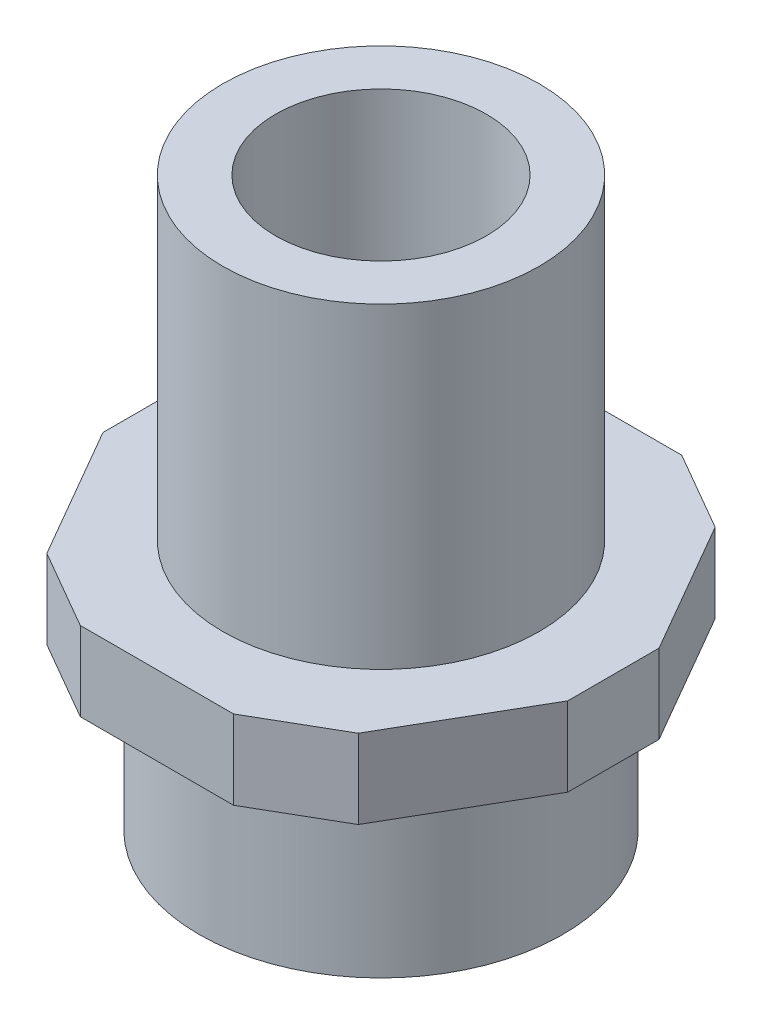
ISO-10303-21;
HEADER;
FILE_DESCRIPTION(('STEP AP214'),'2;1');
FILE_NAME('part.step','',(''),(''),'','','');
FILE_SCHEMA(('AUTOMOTIVE_DESIGN { 1 0 10303 214 1 1 1 1 }'));
ENDSEC;
DATA;
#1=APPLICATION_CONTEXT('core data for automotive mechanical design processes');
#2=APPLICATION_PROTOCOL_DEFINITION('international standard','automotive_design',2000,#1);
#3=PRODUCT_CONTEXT('',#1,'mechanical');
#4=PRODUCT('Part','Part','',(#3));
#5=PRODUCT_RELATED_PRODUCT_CATEGORY('part','',(#4));
#6=PRODUCT_DEFINITION_FORMATION('','',#4);
#7=PRODUCT_DEFINITION_CONTEXT('part definition',#1,'design');
#8=PRODUCT_DEFINITION('design','',#6,#7);
#9=PRODUCT_DEFINITION_SHAPE('','',#8);
#10=(LENGTH_UNIT() NAMED_UNIT(*) SI_UNIT(.MILLI.,.METRE.));
#11=(NAMED_UNIT(*) PLANE_ANGLE_UNIT() SI_UNIT($,.RADIAN.));
#12=(NAMED_UNIT(*) SI_UNIT($,.STERADIAN.) SOLID_ANGLE_UNIT());
#13=UNCERTAINTY_MEASURE_WITH_UNIT(LENGTH_MEASURE(1.E-05),#10,'distance_accuracy_value','');
#14=(GEOMETRIC_REPRESENTATION_CONTEXT(3) GLOBAL_UNCERTAINTY_ASSIGNED_CONTEXT((#13)) GLOBAL_UNIT_ASSIGNED_CONTEXT((#10,
#11,#12)) REPRESENTATION_CONTEXT('',''));
#15=CARTESIAN_POINT('',(0.,0.,0.));
#16=DIRECTION('',(0.,0.,1.));
#17=DIRECTION('',(1.,0.,0.));
#18=AXIS2_PLACEMENT_3D('',#15,#16,#17);
#19=CARTESIAN_POINT('',(9.81495457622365,0.,0.));
#20=DIRECTION('',(0.,1.,0.));
#21=DIRECTION('',(0.,0.,1.));
#22=AXIS2_PLACEMENT_3D('',#19,#20,#21);
#23=PLANE('',#22);
#24=DIRECTION('',(0.5,0.,-0.866025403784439));
#25=VECTOR('',#24,1.);
#26=CARTESIAN_POINT('',(4.90747728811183,0.,8.5));
#27=LINE('',#26,#25);
#28=CARTESIAN_POINT('',(5.90747728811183,0.,6.76794919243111));
#29=VERTEX_POINT('',#28);
#30=CARTESIAN_POINT('',(8.81495457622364,0.,1.73205080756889));
#31=VERTEX_POINT('',#30);
#32=EDGE_CURVE('E144',#29,#31,#27,.T.);
#33=ORIENTED_EDGE('',*,*,#32,.F.);
#34=DIRECTION('',(0.866025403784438,0.,-0.5));
#35=VECTOR('',#34,1.);
#36=CARTESIAN_POINT('',(5.90747728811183,0.,6.76794919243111));
#37=LINE('',#36,#35);
#38=CARTESIAN_POINT('',(2.90747728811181,0.,8.5));
#39=VERTEX_POINT('',#38);
#40=EDGE_CURVE('E127',#29,#39,#37,.F.);
#41=ORIENTED_EDGE('',*,*,#40,.T.);
#42=DIRECTION('',(1.,0.,0.));
#43=VECTOR('',#42,1.);
#44=CARTESIAN_POINT('',(-4.90747728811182,0.,8.5));
#45=LINE('',#44,#43);
#46=CARTESIAN_POINT('',(-2.90747728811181,0.,8.5));
#47=VERTEX_POINT('',#46);
#48=EDGE_CURVE('E173',#47,#39,#45,.T.);
#49=ORIENTED_EDGE('',*,*,#48,.F.);
#50=DIRECTION('',(0.866025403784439,0.,0.5));
#51=VECTOR('',#50,1.);
#52=CARTESIAN_POINT('',(-2.90747728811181,0.,8.5));
#53=LINE('',#52,#51);
#54=CARTESIAN_POINT('',(-5.90747728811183,0.,6.76794919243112));
#55=VERTEX_POINT('',#54);
#56=EDGE_CURVE('E183',#47,#55,#53,.F.);
#57=ORIENTED_EDGE('',*,*,#56,.T.);
#58=DIRECTION('',(0.5,0.,0.866025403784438));
#59=VECTOR('',#58,1.);
#60=CARTESIAN_POINT('',(-9.81495457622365,0.,0.));
#61=LINE('',#60,#59);
#62=CARTESIAN_POINT('',(-8.81495457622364,0.,1.73205080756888));
#63=VERTEX_POINT('',#62);
#64=EDGE_CURVE('E171',#63,#55,#61,.T.);
#65=ORIENTED_EDGE('',*,*,#64,.F.);
#66=DIRECTION('',(0.,0.,1.));
#67=VECTOR('',#66,1.);
#68=CARTESIAN_POINT('',(-8.81495457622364,0.,1.73205080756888));
#69=LINE('',#68,#67);
#70=CARTESIAN_POINT('',(-8.81495457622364,0.,-1.73205080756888));
#71=VERTEX_POINT('',#70);
#72=EDGE_CURVE('E148',#63,#71,#69,.F.);
#73=ORIENTED_EDGE('',*,*,#72,.T.);
#74=DIRECTION('',(-0.5,0.,0.866025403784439));
#75=VECTOR('',#74,1.);
#76=CARTESIAN_POINT('',(-4.90747728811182,0.,-8.50000000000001));
#77=LINE('',#76,#75);
#78=CARTESIAN_POINT('',(-5.90747728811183,0.,-6.76794919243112));
#79=VERTEX_POINT('',#78);
#80=EDGE_CURVE('E168',#79,#71,#77,.T.);
#81=ORIENTED_EDGE('',*,*,#80,.F.);
#82=DIRECTION('',(-0.866025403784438,0.,0.500000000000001));
#83=VECTOR('',#82,1.);
#84=CARTESIAN_POINT('',(-5.90747728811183,0.,-6.76794919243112));
#85=LINE('',#84,#83);
#86=CARTESIAN_POINT('',(-2.90747728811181,0.,-8.50000000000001));
#87=VERTEX_POINT('',#86);
#88=EDGE_CURVE('E185',#79,#87,#85,.F.);
#89=ORIENTED_EDGE('',*,*,#88,.T.);
#90=DIRECTION('',(-1.,0.,0.));
#91=VECTOR('',#90,1.);
#92=CARTESIAN_POINT('',(4.90747728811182,0.,-8.50000000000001));
#93=LINE('',#92,#91);
#94=CARTESIAN_POINT('',(2.90747728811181,0.,-8.50000000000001));
#95=VERTEX_POINT('',#94);
#96=EDGE_CURVE('E157',#95,#87,#93,.T.);
#97=ORIENTED_EDGE('',*,*,#96,.F.);
#98=DIRECTION('',(-0.866025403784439,0.,-0.5));
#99=VECTOR('',#98,1.);
#100=CARTESIAN_POINT('',(2.90747728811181,0.,-8.50000000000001));
#101=LINE('',#100,#99);
#102=CARTESIAN_POINT('',(5.90747728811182,0.,-6.76794919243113));
#103=VERTEX_POINT('',#102);
#104=EDGE_CURVE('E187',#95,#103,#101,.F.);
#105=ORIENTED_EDGE('',*,*,#104,.T.);
#106=DIRECTION('',(-0.5,0.,-0.866025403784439));
#107=VECTOR('',#106,1.);
#108=CARTESIAN_POINT('',(9.81495457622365,0.,0.));
#109=LINE('',#108,#107);
#110=CARTESIAN_POINT('',(8.81495457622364,0.,-1.73205080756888));
#111=VERTEX_POINT('',#110);
#112=EDGE_CURVE('E153',#111,#103,#109,.T.);
#113=ORIENTED_EDGE('',*,*,#112,.F.);
#114=DIRECTION('',(0.,0.,-1.));
#115=VECTOR('',#114,1.);
#116=CARTESIAN_POINT('',(8.81495457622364,0.,-1.73205080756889));
#117=LINE('',#116,#115);
#118=EDGE_CURVE('E138',#111,#31,#117,.F.);
#119=ORIENTED_EDGE('',*,*,#118,.T.);
#120=EDGE_LOOP('',(#33,#41,#49,#57,#65,#73,#81,#89,#97,#105,#113,#119));
#121=FACE_BOUND('',#120,.T.);
#122=CARTESIAN_POINT('',(0.,0.,0.));
#123=DIRECTION('',(0.,1.,0.));
#124=DIRECTION('',(0.,0.,1.));
#125=AXIS2_PLACEMENT_3D('',#122,#123,#124);
#126=CIRCLE('',#125,6.9);
#127=CARTESIAN_POINT('',(0.,0.,6.9));
#128=VERTEX_POINT('',#127);
#129=EDGE_CURVE('E178',#128,#128,#126,.F.);
#130=ORIENTED_EDGE('',*,*,#129,.F.);
#131=EDGE_LOOP('',(#130));
#132=FACE_BOUND('',#131,.T.);
#133=ADVANCED_FACE('F38',(#121,#132),#23,.F.);
#134=CARTESIAN_POINT('',(9.81495457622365,3.,0.));
#135=DIRECTION('',(0.,1.,0.));
#136=DIRECTION('',(0.,0.,1.));
#137=AXIS2_PLACEMENT_3D('',#134,#135,#136);
#138=PLANE('',#137);
#139=DIRECTION('',(1.,0.,0.));
#140=VECTOR('',#139,1.);
#141=CARTESIAN_POINT('',(-4.90747728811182,3.,8.5));
#142=LINE('',#141,#140);
#143=CARTESIAN_POINT('',(-2.90747728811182,3.,8.5));
#144=VERTEX_POINT('',#143);
#145=CARTESIAN_POINT('',(2.90747728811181,3.,8.50000000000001));
#146=VERTEX_POINT('',#145);
#147=EDGE_CURVE('E163',#144,#146,#142,.T.);
#148=ORIENTED_EDGE('',*,*,#147,.T.);
#149=DIRECTION('',(-0.866025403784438,0.,0.5));
#150=VECTOR('',#149,1.);
#151=CARTESIAN_POINT('',(11.7686932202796,3.,3.38397459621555));
#152=LINE('',#151,#150);
#153=CARTESIAN_POINT('',(5.90747728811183,3.,6.76794919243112));
#154=VERTEX_POINT('',#153);
#155=EDGE_CURVE('E202',#146,#154,#152,.F.);
#156=ORIENTED_EDGE('',*,*,#155,.T.);
#157=DIRECTION('',(0.5,0.,-0.866025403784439));
#158=VECTOR('',#157,1.);
#159=CARTESIAN_POINT('',(4.90747728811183,3.,8.5));
#160=LINE('',#159,#158);
#161=CARTESIAN_POINT('',(8.81495457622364,3.,1.73205080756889));
#162=VERTEX_POINT('',#161);
#163=EDGE_CURVE('E147',#154,#162,#160,.T.);
#164=ORIENTED_EDGE('',*,*,#163,.T.);
#165=DIRECTION('',(0.,0.,1.));
#166=VECTOR('',#165,1.);
#167=CARTESIAN_POINT('',(8.81495457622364,3.,0.));
#168=LINE('',#167,#166);
#169=CARTESIAN_POINT('',(8.81495457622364,3.,-1.73205080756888));
#170=VERTEX_POINT('',#169);
#171=EDGE_CURVE('E200',#162,#170,#168,.F.);
#172=ORIENTED_EDGE('',*,*,#171,.T.);
#173=DIRECTION('',(-0.5,0.,-0.866025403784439));
#174=VECTOR('',#173,1.);
#175=CARTESIAN_POINT('',(9.81495457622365,3.,0.));
#176=LINE('',#175,#174);
#177=CARTESIAN_POINT('',(5.90747728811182,3.,-6.76794919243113));
#178=VERTEX_POINT('',#177);
#179=EDGE_CURVE('E239',#170,#178,#176,.T.);
#180=ORIENTED_EDGE('',*,*,#179,.T.);
#181=DIRECTION('',(0.866025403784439,0.,0.5));
#182=VECTOR('',#181,1.);
#183=CARTESIAN_POINT('',(11.7686932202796,3.,-3.38397459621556));
#184=LINE('',#183,#182);
#185=CARTESIAN_POINT('',(2.90747728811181,3.,-8.50000000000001));
#186=VERTEX_POINT('',#185);
#187=EDGE_CURVE('E198',#178,#186,#184,.F.);
#188=ORIENTED_EDGE('',*,*,#187,.T.);
#189=DIRECTION('',(-1.,0.,0.));
#190=VECTOR('',#189,1.);
#191=CARTESIAN_POINT('',(4.90747728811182,3.,-8.50000000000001));
#192=LINE('',#191,#190);
#193=CARTESIAN_POINT('',(-2.90747728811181,3.,-8.50000000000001));
#194=VERTEX_POINT('',#193);
#195=EDGE_CURVE('E234',#186,#194,#192,.T.);
#196=ORIENTED_EDGE('',*,*,#195,.T.);
#197=DIRECTION('',(0.866025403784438,0.,-0.500000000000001));
#198=VECTOR('',#197,1.);
#199=CARTESIAN_POINT('',(2.9537386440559,3.,-11.8839745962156));
#200=LINE('',#199,#198);
#201=CARTESIAN_POINT('',(-5.90747728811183,3.,-6.76794919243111));
#202=VERTEX_POINT('',#201);
#203=EDGE_CURVE('E196',#194,#202,#200,.F.);
#204=ORIENTED_EDGE('',*,*,#203,.T.);
#205=DIRECTION('',(-0.5,0.,0.866025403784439));
#206=VECTOR('',#205,1.);
#207=CARTESIAN_POINT('',(-4.90747728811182,3.,-8.50000000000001));
#208=LINE('',#207,#206);
#209=CARTESIAN_POINT('',(-8.81495457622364,3.,-1.73205080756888));
#210=VERTEX_POINT('',#209);
#211=EDGE_CURVE('E233',#202,#210,#208,.T.);
#212=ORIENTED_EDGE('',*,*,#211,.T.);
#213=DIRECTION('',(0.,0.,-1.));
#214=VECTOR('',#213,1.);
#215=CARTESIAN_POINT('',(-8.81495457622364,3.,0.));
#216=LINE('',#215,#214);
#217=CARTESIAN_POINT('',(-8.81495457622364,3.,1.73205080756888));
#218=VERTEX_POINT('',#217);
#219=EDGE_CURVE('E58',#210,#218,#216,.F.);
#220=ORIENTED_EDGE('',*,*,#219,.T.);
#221=DIRECTION('',(0.5,0.,0.866025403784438));
#222=VECTOR('',#221,1.);
#223=CARTESIAN_POINT('',(-9.81495457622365,3.,0.));
#224=LINE('',#223,#222);
#225=CARTESIAN_POINT('',(-5.90747728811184,3.,6.76794919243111));
#226=VERTEX_POINT('',#225);
#227=EDGE_CURVE('E222',#218,#226,#224,.T.);
#228=ORIENTED_EDGE('',*,*,#227,.T.);
#229=DIRECTION('',(-0.866025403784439,0.,-0.5));
#230=VECTOR('',#229,1.);
#231=CARTESIAN_POINT('',(2.95373864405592,3.,11.8839745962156));
#232=LINE('',#231,#230);
#233=EDGE_CURVE('E194',#226,#144,#232,.F.);
#234=ORIENTED_EDGE('',*,*,#233,.T.);
#235=EDGE_LOOP('',(#148,#156,#164,#172,#180,#188,#196,#204,#212,#220,#228,#234));
#236=FACE_BOUND('',#235,.T.);
#237=CARTESIAN_POINT('',(0.,3.,0.));
#238=DIRECTION('',(0.,1.,0.));
#239=DIRECTION('',(0.,0.,1.));
#240=AXIS2_PLACEMENT_3D('',#237,#238,#239);
#241=CIRCLE('',#240,6.);
#242=CARTESIAN_POINT('',(0.,3.,6.));
#243=VERTEX_POINT('',#242);
#244=EDGE_CURVE('E160',#243,#243,#241,.T.);
#245=ORIENTED_EDGE('',*,*,#244,.F.);
#246=EDGE_LOOP('',(#245));
#247=FACE_BOUND('',#246,.T.);
#248=ADVANCED_FACE('F261',(#236,#247),#138,.T.);
#249=CARTESIAN_POINT('',(4.90747728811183,3.,8.5));
#250=DIRECTION('',(-0.866025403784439,0.,-0.5));
#251=DIRECTION('',(-0.5,0.,0.866025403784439));
#252=AXIS2_PLACEMENT_3D('',#249,#250,#251);
#253=PLANE('',#252);
#254=ORIENTED_EDGE('',*,*,#163,.F.);
#255=DIRECTION('',(0.,-1.,0.));
#256=VECTOR('',#255,1.);
#257=CARTESIAN_POINT('',(5.90747728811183,3.,6.76794919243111));
#258=LINE('',#257,#256);
#259=EDGE_CURVE('E131',#154,#29,#258,.T.);
#260=ORIENTED_EDGE('',*,*,#259,.T.);
#261=ORIENTED_EDGE('',*,*,#32,.T.);
#262=DIRECTION('',(0.,1.,0.));
#263=VECTOR('',#262,1.);
#264=CARTESIAN_POINT('',(8.81495457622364,3.,1.73205080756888));
#265=LINE('',#264,#263);
#266=EDGE_CURVE('E149',#31,#162,#265,.T.);
#267=ORIENTED_EDGE('',*,*,#266,.T.);
#268=EDGE_LOOP('',(#254,#260,#261,#267));
#269=FACE_BOUND('',#268,.T.);
#270=ADVANCED_FACE('F143',(#269),#253,.F.);
#271=CARTESIAN_POINT('',(9.81495457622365,3.,0.));
#272=DIRECTION('',(-0.866025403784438,0.,0.5));
#273=DIRECTION('',(0.5,0.,0.866025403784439));
#274=AXIS2_PLACEMENT_3D('',#271,#272,#273);
#275=PLANE('',#274);
#276=ORIENTED_EDGE('',*,*,#179,.F.);
#277=DIRECTION('',(0.,-1.,0.));
#278=VECTOR('',#277,1.);
#279=CARTESIAN_POINT('',(8.81495457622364,3.,-1.73205080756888));
#280=LINE('',#279,#278);
#281=EDGE_CURVE('E206',#170,#111,#280,.T.);
#282=ORIENTED_EDGE('',*,*,#281,.T.);
#283=ORIENTED_EDGE('',*,*,#112,.T.);
#284=DIRECTION('',(0.,1.,0.));
#285=VECTOR('',#284,1.);
#286=CARTESIAN_POINT('',(5.90747728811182,3.,-6.76794919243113));
#287=LINE('',#286,#285);
#288=EDGE_CURVE('E204',#103,#178,#287,.T.);
#289=ORIENTED_EDGE('',*,*,#288,.T.);
#290=EDGE_LOOP('',(#276,#282,#283,#289));
#291=FACE_BOUND('',#290,.T.);
#292=ADVANCED_FACE('F281',(#291),#275,.F.);
#293=CARTESIAN_POINT('',(4.90747728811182,3.,-8.50000000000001));
#294=DIRECTION('',(0.,0.,1.));
#295=DIRECTION('',(1.,0.,0.));
#296=AXIS2_PLACEMENT_3D('',#293,#294,#295);
#297=PLANE('',#296);
#298=ORIENTED_EDGE('',*,*,#195,.F.);
#299=DIRECTION('',(0.,-1.,0.));
#300=VECTOR('',#299,1.);
#301=CARTESIAN_POINT('',(2.90747728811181,3.,-8.50000000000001));
#302=LINE('',#301,#300);
#303=EDGE_CURVE('E211',#186,#95,#302,.T.);
#304=ORIENTED_EDGE('',*,*,#303,.T.);
#305=ORIENTED_EDGE('',*,*,#96,.T.);
#306=DIRECTION('',(0.,1.,0.));
#307=VECTOR('',#306,1.);
#308=CARTESIAN_POINT('',(-2.90747728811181,3.,-8.50000000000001));
#309=LINE('',#308,#307);
#310=EDGE_CURVE('E209',#87,#194,#309,.T.);
#311=ORIENTED_EDGE('',*,*,#310,.T.);
#312=EDGE_LOOP('',(#298,#304,#305,#311));
#313=FACE_BOUND('',#312,.T.);
#314=ADVANCED_FACE('F277',(#313),#297,.F.);
#315=CARTESIAN_POINT('',(-4.90747728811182,3.,-8.50000000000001));
#316=DIRECTION('',(0.866025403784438,0.,0.5));
#317=DIRECTION('',(0.5,0.,-0.866025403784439));
#318=AXIS2_PLACEMENT_3D('',#315,#316,#317);
#319=PLANE('',#318);
#320=ORIENTED_EDGE('',*,*,#211,.F.);
#321=DIRECTION('',(0.,-1.,0.));
#322=VECTOR('',#321,1.);
#323=CARTESIAN_POINT('',(-5.90747728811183,3.,-6.76794919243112));
#324=LINE('',#323,#322);
#325=EDGE_CURVE('E216',#202,#79,#324,.T.);
#326=ORIENTED_EDGE('',*,*,#325,.T.);
#327=ORIENTED_EDGE('',*,*,#80,.T.);
#328=DIRECTION('',(0.,1.,0.));
#329=VECTOR('',#328,1.);
#330=CARTESIAN_POINT('',(-8.81495457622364,3.,-1.73205080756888));
#331=LINE('',#330,#329);
#332=EDGE_CURVE('E214',#71,#210,#331,.T.);
#333=ORIENTED_EDGE('',*,*,#332,.T.);
#334=EDGE_LOOP('',(#320,#326,#327,#333));
#335=FACE_BOUND('',#334,.T.);
#336=ADVANCED_FACE('F274',(#335),#319,.F.);
#337=CARTESIAN_POINT('',(-9.81495457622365,3.,0.));
#338=DIRECTION('',(0.866025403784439,0.,-0.5));
#339=DIRECTION('',(-0.5,0.,-0.866025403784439));
#340=AXIS2_PLACEMENT_3D('',#337,#338,#339);
#341=PLANE('',#340);
#342=ORIENTED_EDGE('',*,*,#64,.T.);
#343=DIRECTION('',(0.,1.,0.));
#344=VECTOR('',#343,1.);
#345=CARTESIAN_POINT('',(-5.90747728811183,3.,6.76794919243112));
#346=LINE('',#345,#344);
#347=EDGE_CURVE('E11',#55,#226,#346,.T.);
#348=ORIENTED_EDGE('',*,*,#347,.T.);
#349=ORIENTED_EDGE('',*,*,#227,.F.);
#350=DIRECTION('',(0.,-1.,0.));
#351=VECTOR('',#350,1.);
#352=CARTESIAN_POINT('',(-8.81495457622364,3.,1.73205080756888));
#353=LINE('',#352,#351);
#354=EDGE_CURVE('E46',#218,#63,#353,.T.);
#355=ORIENTED_EDGE('',*,*,#354,.T.);
#356=EDGE_LOOP('',(#342,#348,#349,#355));
#357=FACE_BOUND('',#356,.T.);
#358=ADVANCED_FACE('F221',(#357),#341,.F.);
#359=CARTESIAN_POINT('',(-4.90747728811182,3.,8.5));
#360=DIRECTION('',(0.,0.,-1.));
#361=DIRECTION('',(-1.,0.,0.));
#362=AXIS2_PLACEMENT_3D('',#359,#360,#361);
#363=PLANE('',#362);
#364=ORIENTED_EDGE('',*,*,#48,.T.);
#365=DIRECTION('',(0.,1.,0.));
#366=VECTOR('',#365,1.);
#367=CARTESIAN_POINT('',(2.90747728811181,3.,8.5));
#368=LINE('',#367,#366);
#369=EDGE_CURVE('E132',#39,#146,#368,.T.);
#370=ORIENTED_EDGE('',*,*,#369,.T.);
#371=ORIENTED_EDGE('',*,*,#147,.F.);
#372=DIRECTION('',(0.,-1.,0.));
#373=VECTOR('',#372,1.);
#374=CARTESIAN_POINT('',(-2.90747728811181,3.,8.5));
#375=LINE('',#374,#373);
#376=EDGE_CURVE('E137',#144,#47,#375,.T.);
#377=ORIENTED_EDGE('',*,*,#376,.T.);
#378=EDGE_LOOP('',(#364,#370,#371,#377));
#379=FACE_BOUND('',#378,.T.);
#380=ADVANCED_FACE('F231',(#379),#363,.F.);
#381=CARTESIAN_POINT('',(0.,15.,0.));
#382=DIRECTION('',(0.,1.,0.));
#383=DIRECTION('',(0.,0.,1.));
#384=AXIS2_PLACEMENT_3D('',#381,#382,#383);
#385=PLANE('',#384);
#386=CARTESIAN_POINT('',(0.,15.,0.));
#387=DIRECTION('',(0.,1.,0.));
#388=DIRECTION('',(0.,0.,1.));
#389=AXIS2_PLACEMENT_3D('',#386,#387,#388);
#390=CIRCLE('',#389,6.);
#391=CARTESIAN_POINT('',(0.,15.,6.));
#392=VERTEX_POINT('',#391);
#393=EDGE_CURVE('E154',#392,#392,#390,.T.);
#394=ORIENTED_EDGE('',*,*,#393,.T.);
#395=EDGE_LOOP('',(#394));
#396=FACE_BOUND('',#395,.T.);
#397=CARTESIAN_POINT('',(0.,15.,0.));
#398=DIRECTION('',(0.,1.,0.));
#399=DIRECTION('',(0.,0.,1.));
#400=AXIS2_PLACEMENT_3D('',#397,#398,#399);
#401=CIRCLE('',#400,4.);
#402=CARTESIAN_POINT('',(0.,15.,4.));
#403=VERTEX_POINT('',#402);
#404=EDGE_CURVE('E244',#403,#403,#401,.T.);
#405=ORIENTED_EDGE('',*,*,#404,.F.);
#406=EDGE_LOOP('',(#405));
#407=FACE_BOUND('',#406,.T.);
#408=ADVANCED_FACE('F271',(#396,#407),#385,.T.);
#409=CARTESIAN_POINT('',(0.,15.,0.));
#410=DIRECTION('',(0.,-1.,0.));
#411=DIRECTION('',(0.,0.,-1.));
#412=AXIS2_PLACEMENT_3D('',#409,#410,#411);
#413=CYLINDRICAL_SURFACE('',#412,6.);
#414=ORIENTED_EDGE('',*,*,#393,.F.);
#415=EDGE_LOOP('',(#414));
#416=FACE_BOUND('',#415,.T.);
#417=ORIENTED_EDGE('',*,*,#244,.T.);
#418=EDGE_LOOP('',(#417));
#419=FACE_BOUND('',#418,.T.);
#420=ADVANCED_FACE('F323',(#416,#419),#413,.T.);
#421=CARTESIAN_POINT('',(0.,15.,0.));
#422=DIRECTION('',(0.,-1.,0.));
#423=DIRECTION('',(0.,0.,-1.));
#424=AXIS2_PLACEMENT_3D('',#421,#422,#423);
#425=CYLINDRICAL_SURFACE('',#424,4.);
#426=ORIENTED_EDGE('',*,*,#404,.T.);
#427=EDGE_LOOP('',(#426));
#428=FACE_BOUND('',#427,.T.);
#429=CARTESIAN_POINT('',(0.,3.,0.));
#430=DIRECTION('',(0.,1.,0.));
#431=DIRECTION('',(0.,0.,1.));
#432=AXIS2_PLACEMENT_3D('',#429,#430,#431);
#433=CIRCLE('',#432,4.);
#434=CARTESIAN_POINT('',(0.,3.,4.));
#435=VERTEX_POINT('',#434);
#436=EDGE_CURVE('E175',#435,#435,#433,.F.);
#437=ORIENTED_EDGE('',*,*,#436,.T.);
#438=EDGE_LOOP('',(#437));
#439=FACE_BOUND('',#438,.T.);
#440=ADVANCED_FACE('F325',(#428,#439),#425,.F.);
#441=ORIENTED_EDGE('',*,*,#436,.F.);
#442=EDGE_LOOP('',(#441));
#443=FACE_BOUND('',#442,.T.);
#444=ADVANCED_FACE('F257',(#443),#138,.T.);
#445=CARTESIAN_POINT('',(0.,-6.5,0.));
#446=DIRECTION('',(0.,1.,0.));
#447=DIRECTION('',(0.,0.,1.));
#448=AXIS2_PLACEMENT_3D('',#445,#446,#447);
#449=CYLINDRICAL_SURFACE('',#448,6.9);
#450=CARTESIAN_POINT('',(0.,-6.5,0.));
#451=DIRECTION('',(0.,-1.,0.));
#452=DIRECTION('',(0.,0.,-1.));
#453=AXIS2_PLACEMENT_3D('',#450,#451,#452);
#454=CIRCLE('',#453,6.9);
#455=CARTESIAN_POINT('',(0.,-6.5,6.9));
#456=VERTEX_POINT('',#455);
#457=EDGE_CURVE('E248',#456,#456,#454,.T.);
#458=CARTESIAN_POINT('',(0.,-6.5,6.9));
#459=CARTESIAN_POINT('',(0.,-6.43229166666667,6.9));
#460=CARTESIAN_POINT('',(0.,-6.36458333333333,6.9));
#461=CARTESIAN_POINT('',(0.,-6.22916666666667,6.9));
#462=CARTESIAN_POINT('',(0.,-6.16145833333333,6.9));
#463=CARTESIAN_POINT('',(0.,-6.02604166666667,6.9));
#464=CARTESIAN_POINT('',(0.,-5.95833333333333,6.9));
#465=CARTESIAN_POINT('',(0.,-5.82291666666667,6.9));
#466=CARTESIAN_POINT('',(0.,-5.75520833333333,6.9));
#467=CARTESIAN_POINT('',(0.,-5.61979166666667,6.9));
#468=CARTESIAN_POINT('',(0.,-5.55208333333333,6.9));
#469=CARTESIAN_POINT('',(0.,-5.41666666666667,6.9));
#470=CARTESIAN_POINT('',(0.,-5.34895833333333,6.9));
#471=CARTESIAN_POINT('',(0.,-5.21354166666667,6.9));
#472=CARTESIAN_POINT('',(0.,-5.14583333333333,6.9));
#473=CARTESIAN_POINT('',(0.,-5.01041666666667,6.9));
#474=CARTESIAN_POINT('',(0.,-4.94270833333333,6.9));
#475=CARTESIAN_POINT('',(0.,-4.80729166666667,6.9));
#476=CARTESIAN_POINT('',(0.,-4.73958333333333,6.9));
#477=CARTESIAN_POINT('',(0.,-4.60416666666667,6.9));
#478=CARTESIAN_POINT('',(0.,-4.53645833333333,6.9));
#479=CARTESIAN_POINT('',(0.,-4.40104166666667,6.9));
#480=CARTESIAN_POINT('',(0.,-4.33333333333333,6.9));
#481=CARTESIAN_POINT('',(0.,-4.19791666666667,6.9));
#482=CARTESIAN_POINT('',(0.,-4.13020833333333,6.9));
#483=CARTESIAN_POINT('',(0.,-3.99479166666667,6.9));
#484=CARTESIAN_POINT('',(0.,-3.92708333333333,6.9));
#485=CARTESIAN_POINT('',(0.,-3.79166666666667,6.9));
#486=CARTESIAN_POINT('',(0.,-3.72395833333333,6.9));
#487=CARTESIAN_POINT('',(0.,-3.58854166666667,6.9));
#488=CARTESIAN_POINT('',(0.,-3.52083333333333,6.9));
#489=CARTESIAN_POINT('',(0.,-3.38541666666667,6.9));
#490=CARTESIAN_POINT('',(0.,-3.31770833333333,6.9));
#491=CARTESIAN_POINT('',(0.,-3.18229166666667,6.9));
#492=CARTESIAN_POINT('',(0.,-3.11458333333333,6.9));
#493=CARTESIAN_POINT('',(0.,-2.97916666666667,6.9));
#494=CARTESIAN_POINT('',(0.,-2.91145833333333,6.9));
#495=CARTESIAN_POINT('',(0.,-2.77604166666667,6.9));
#496=CARTESIAN_POINT('',(0.,-2.70833333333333,6.9));
#497=CARTESIAN_POINT('',(0.,-2.57291666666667,6.9));
#498=CARTESIAN_POINT('',(0.,-2.50520833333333,6.9));
#499=CARTESIAN_POINT('',(0.,-2.36979166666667,6.9));
#500=CARTESIAN_POINT('',(0.,-2.30208333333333,6.9));
#501=CARTESIAN_POINT('',(0.,-2.16666666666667,6.9));
#502=CARTESIAN_POINT('',(0.,-2.09895833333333,6.9));
#503=CARTESIAN_POINT('',(0.,-1.96354166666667,6.9));
#504=CARTESIAN_POINT('',(0.,-1.89583333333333,6.9));
#505=CARTESIAN_POINT('',(0.,-1.76041666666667,6.9));
#506=CARTESIAN_POINT('',(0.,-1.69270833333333,6.9));
#507=CARTESIAN_POINT('',(0.,-1.55729166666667,6.9));
#508=CARTESIAN_POINT('',(0.,-1.48958333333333,6.9));
#509=CARTESIAN_POINT('',(0.,-1.35416666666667,6.9));
#510=CARTESIAN_POINT('',(0.,-1.28645833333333,6.9));
#511=CARTESIAN_POINT('',(0.,-1.15104166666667,6.9));
#512=CARTESIAN_POINT('',(0.,-1.08333333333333,6.9));
#513=CARTESIAN_POINT('',(0.,-0.947916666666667,6.9));
#514=CARTESIAN_POINT('',(0.,-0.880208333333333,6.9));
#515=CARTESIAN_POINT('',(0.,-0.744791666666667,6.9));
#516=CARTESIAN_POINT('',(0.,-0.677083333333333,6.9));
#517=CARTESIAN_POINT('',(0.,-0.541666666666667,6.9));
#518=CARTESIAN_POINT('',(0.,-0.473958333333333,6.9));
#519=CARTESIAN_POINT('',(0.,-0.338541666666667,6.9));
#520=CARTESIAN_POINT('',(0.,-0.270833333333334,6.9));
#521=CARTESIAN_POINT('',(0.,-0.135416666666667,6.9));
#522=CARTESIAN_POINT('',(0.,-0.0677083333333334,6.9));
#523=CARTESIAN_POINT('',(0.,0.,6.9));
#524=B_SPLINE_CURVE_WITH_KNOTS('',3,(#458,#459,#460,#461,#462,#463,#464,#465,#466,#467,#468,
#469,#470,#471,#472,#473,#474,#475,#476,#477,#478,#479,#480,#481,#482,#483,#484,#485,#486,#487,
#488,#489,#490,#491,#492,#493,#494,#495,#496,#497,#498,#499,#500,#501,#502,#503,#504,#505,#506,
#507,#508,#509,#510,#511,#512,#513,#514,#515,#516,#517,#518,#519,#520,#521,#522,#523),
.UNSPECIFIED.,.F.,.F.,(4,2,2,2,2,2,2,2,2,2,2,2,2,2,2,2,2,2,2,2,2,2,2,2,2,2,2,2,2,2,2,2,4),(0.,
0.203124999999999,0.40625,0.609375,0.812499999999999,1.015625,1.21875,1.421875,1.625,1.828125,
2.03125,2.234375,2.4375,2.640625,2.84375,3.046875,3.25,3.453125,3.65625,3.859375,4.0625,
4.265625,4.46875,4.671875,4.875,5.078125,5.28125,5.484375,5.6875,5.890625,6.09375,6.296875,6.5),.UNSPECIFIED.);
#525=EDGE_CURVE('BSEAM254',#456,#128,#524,.T.);
#526=ORIENTED_EDGE('',*,*,#457,.F.);
#527=ORIENTED_EDGE('',*,*,#129,.T.);
#528=ORIENTED_EDGE('',*,*,#525,.T.);
#529=ORIENTED_EDGE('',*,*,#525,.F.);
#530=EDGE_LOOP('',(#526,#528,#527,#529));
#531=FACE_BOUND('',#530,.T.);
#532=ADVANCED_FACE('F254',(#531),#449,.T.);
#533=CARTESIAN_POINT('',(0.,-6.5,0.));
#534=DIRECTION('',(0.,-1.,0.));
#535=DIRECTION('',(0.,0.,-1.));
#536=AXIS2_PLACEMENT_3D('',#533,#534,#535);
#537=PLANE('',#536);
#538=ORIENTED_EDGE('',*,*,#457,.T.);
#539=EDGE_LOOP('',(#538));
#540=FACE_BOUND('',#539,.T.);
#541=ADVANCED_FACE('F252',(#540),#537,.T.);
#542=CARTESIAN_POINT('',(5.90747728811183,3.,6.76794919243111));
#543=DIRECTION('',(-0.5,0.,-0.866025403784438));
#544=DIRECTION('',(-0.866025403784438,0.,0.5));
#545=AXIS2_PLACEMENT_3D('',#542,#543,#544);
#546=PLANE('',#545);
#547=ORIENTED_EDGE('',*,*,#155,.F.);
#548=ORIENTED_EDGE('',*,*,#369,.F.);
#549=ORIENTED_EDGE('',*,*,#40,.F.);
#550=ORIENTED_EDGE('',*,*,#259,.F.);
#551=EDGE_LOOP('',(#547,#548,#549,#550));
#552=FACE_BOUND('',#551,.T.);
#553=ADVANCED_FACE('F130',(#552),#546,.F.);
#554=CARTESIAN_POINT('',(8.81495457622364,3.,-1.73205080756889));
#555=DIRECTION('',(-1.,0.,0.));
#556=DIRECTION('',(0.,0.,1.));
#557=AXIS2_PLACEMENT_3D('',#554,#555,#556);
#558=PLANE('',#557);
#559=ORIENTED_EDGE('',*,*,#171,.F.);
#560=ORIENTED_EDGE('',*,*,#266,.F.);
#561=ORIENTED_EDGE('',*,*,#118,.F.);
#562=ORIENTED_EDGE('',*,*,#281,.F.);
#563=EDGE_LOOP('',(#559,#560,#561,#562));
#564=FACE_BOUND('',#563,.T.);
#565=ADVANCED_FACE('F290',(#564),#558,.F.);
#566=CARTESIAN_POINT('',(2.90747728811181,3.,-8.50000000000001));
#567=DIRECTION('',(-0.5,0.,0.866025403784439));
#568=DIRECTION('',(0.866025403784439,0.,0.5));
#569=AXIS2_PLACEMENT_3D('',#566,#567,#568);
#570=PLANE('',#569);
#571=ORIENTED_EDGE('',*,*,#187,.F.);
#572=ORIENTED_EDGE('',*,*,#288,.F.);
#573=ORIENTED_EDGE('',*,*,#104,.F.);
#574=ORIENTED_EDGE('',*,*,#303,.F.);
#575=EDGE_LOOP('',(#571,#572,#573,#574));
#576=FACE_BOUND('',#575,.T.);
#577=ADVANCED_FACE('F293',(#576),#570,.F.);
#578=CARTESIAN_POINT('',(-5.90747728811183,3.,-6.76794919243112));
#579=DIRECTION('',(0.500000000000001,0.,0.866025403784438));
#580=DIRECTION('',(0.866025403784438,0.,-0.500000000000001));
#581=AXIS2_PLACEMENT_3D('',#578,#579,#580);
#582=PLANE('',#581);
#583=ORIENTED_EDGE('',*,*,#203,.F.);
#584=ORIENTED_EDGE('',*,*,#310,.F.);
#585=ORIENTED_EDGE('',*,*,#88,.F.);
#586=ORIENTED_EDGE('',*,*,#325,.F.);
#587=EDGE_LOOP('',(#583,#584,#585,#586));
#588=FACE_BOUND('',#587,.T.);
#589=ADVANCED_FACE('F297',(#588),#582,.F.);
#590=CARTESIAN_POINT('',(-2.90747728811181,3.,8.5));
#591=DIRECTION('',(0.5,0.,-0.866025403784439));
#592=DIRECTION('',(-0.866025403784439,0.,-0.5));
#593=AXIS2_PLACEMENT_3D('',#590,#591,#592);
#594=PLANE('',#593);
#595=ORIENTED_EDGE('',*,*,#233,.F.);
#596=ORIENTED_EDGE('',*,*,#347,.F.);
#597=ORIENTED_EDGE('',*,*,#56,.F.);
#598=ORIENTED_EDGE('',*,*,#376,.F.);
#599=EDGE_LOOP('',(#595,#596,#597,#598));
#600=FACE_BOUND('',#599,.T.);
#601=ADVANCED_FACE('F228',(#600),#594,.F.);
#602=CARTESIAN_POINT('',(-8.81495457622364,3.,1.73205080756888));
#603=DIRECTION('',(1.,0.,0.));
#604=DIRECTION('',(0.,0.,-1.));
#605=AXIS2_PLACEMENT_3D('',#602,#603,#604);
#606=PLANE('',#605);
#607=ORIENTED_EDGE('',*,*,#219,.F.);
#608=ORIENTED_EDGE('',*,*,#332,.F.);
#609=ORIENTED_EDGE('',*,*,#72,.F.);
#610=ORIENTED_EDGE('',*,*,#354,.F.);
#611=EDGE_LOOP('',(#607,#608,#609,#610));
#612=FACE_BOUND('',#611,.T.);
#613=ADVANCED_FACE('F40',(#612),#606,.F.);
#614=CLOSED_SHELL('',(#133,#248,#270,#292,#314,#336,#358,#380,#408,#420,#440,#444,#532,#541,
#553,#565,#577,#589,#601,#613));
#615=MANIFOLD_SOLID_BREP('B2',#614);
#616=ADVANCED_BREP_SHAPE_REPRESENTATION('',(#18,#615),#14);
#617=SHAPE_DEFINITION_REPRESENTATION(#9,#616);
ENDSEC;
END-ISO-10303-21;
